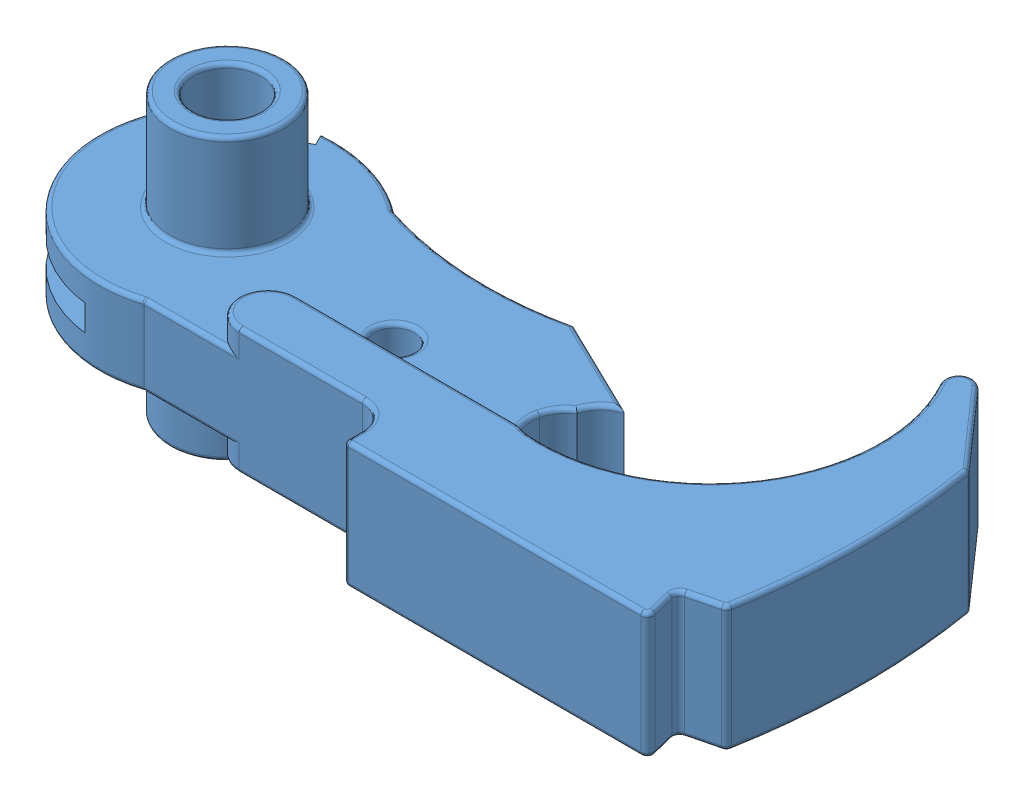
SolidWorks assembly HAMMER.SLDASM, configuration Default (file format 11000). Lengths in mm.
Overall size (46.68 17.3 22.68).
2 component instances, 2 part files, 0 mates.
Components (placement in the parent):
- HAMMER-1: HAMMER.SLDPRT [Default] at origin size (46.68 17.3 22.68)
- HAMMER RETAINER PIN-1: HAMMER RETAINER PIN.SLDPRT [Default] at (12.1922 0 0) x (0 0 -1) z (1 0 0) size (1.37 1.37 20.32)
